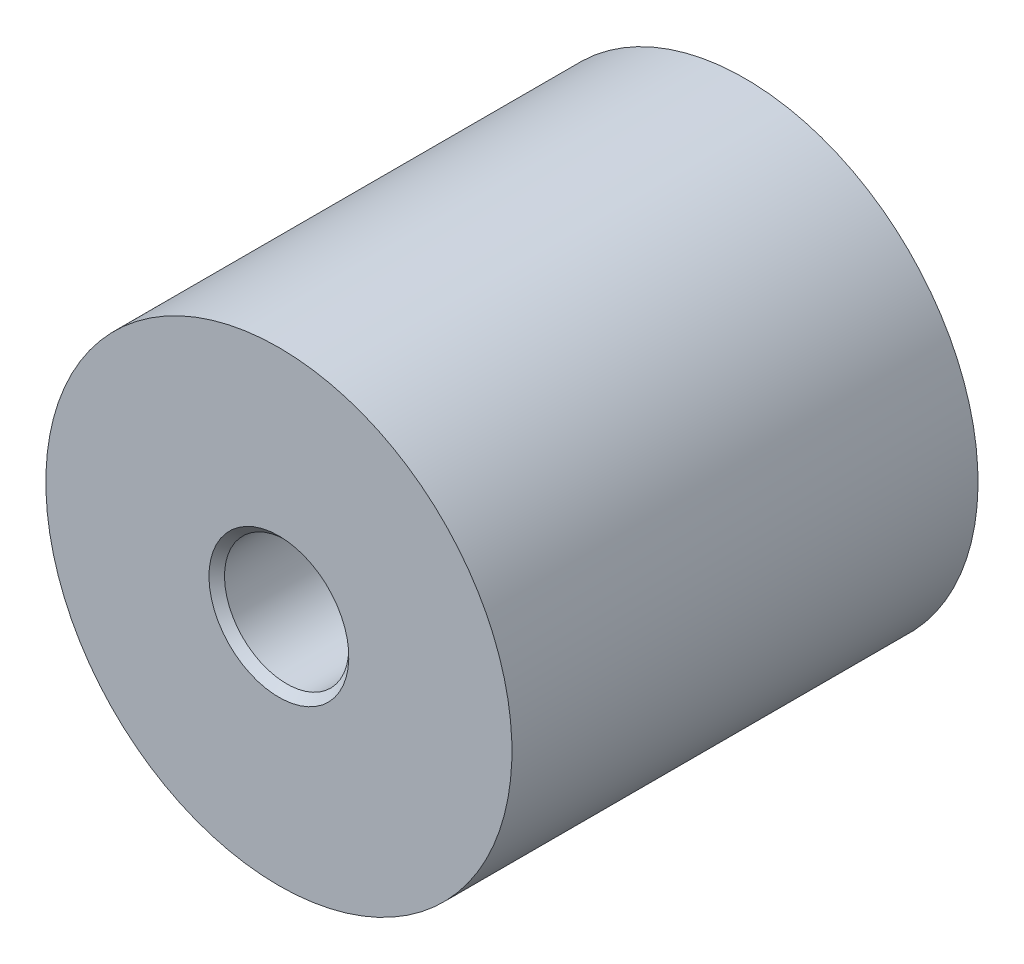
ISO-10303-21;
HEADER;
FILE_DESCRIPTION(('STEP AP214'),'2;1');
FILE_NAME('part.step','',(''),(''),'','','');
FILE_SCHEMA(('AUTOMOTIVE_DESIGN { 1 0 10303 214 1 1 1 1 }'));
ENDSEC;
DATA;
#1=APPLICATION_CONTEXT('core data for automotive mechanical design processes');
#2=APPLICATION_PROTOCOL_DEFINITION('international standard','automotive_design',2000,#1);
#3=PRODUCT_CONTEXT('',#1,'mechanical');
#4=PRODUCT('Part','Part','',(#3));
#5=PRODUCT_RELATED_PRODUCT_CATEGORY('part','',(#4));
#6=PRODUCT_DEFINITION_FORMATION('','',#4);
#7=PRODUCT_DEFINITION_CONTEXT('part definition',#1,'design');
#8=PRODUCT_DEFINITION('design','',#6,#7);
#9=PRODUCT_DEFINITION_SHAPE('','',#8);
#10=(LENGTH_UNIT() NAMED_UNIT(*) SI_UNIT(.MILLI.,.METRE.));
#11=(NAMED_UNIT(*) PLANE_ANGLE_UNIT() SI_UNIT($,.RADIAN.));
#12=(NAMED_UNIT(*) SI_UNIT($,.STERADIAN.) SOLID_ANGLE_UNIT());
#13=UNCERTAINTY_MEASURE_WITH_UNIT(LENGTH_MEASURE(1.E-05),#10,'distance_accuracy_value','');
#14=(GEOMETRIC_REPRESENTATION_CONTEXT(3) GLOBAL_UNCERTAINTY_ASSIGNED_CONTEXT((#13)) GLOBAL_UNIT_ASSIGNED_CONTEXT((#10,
#11,#12)) REPRESENTATION_CONTEXT('',''));
#15=CARTESIAN_POINT('',(0.,0.,0.));
#16=DIRECTION('',(0.,0.,1.));
#17=DIRECTION('',(1.,0.,0.));
#18=AXIS2_PLACEMENT_3D('',#15,#16,#17);
#19=CARTESIAN_POINT('',(0.,0.,0.66666666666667));
#20=DIRECTION('',(0.,0.,1.));
#21=DIRECTION('',(0.,-1.,0.));
#22=AXIS2_PLACEMENT_3D('',#19,#20,#21);
#23=CYLINDRICAL_SURFACE('',#22,15.);
#24=CARTESIAN_POINT('',(0.,0.,0.));
#25=DIRECTION('',(0.,0.,1.));
#26=DIRECTION('',(0.,-1.,0.));
#27=AXIS2_PLACEMENT_3D('',#24,#25,#26);
#28=CIRCLE('',#27,15.);
#29=CARTESIAN_POINT('',(0.,-15.,0.));
#30=VERTEX_POINT('',#29);
#31=EDGE_CURVE('E23',#30,#30,#28,.T.);
#32=ORIENTED_EDGE('',*,*,#31,.T.);
#33=EDGE_LOOP('',(#32));
#34=FACE_BOUND('',#33,.T.);
#35=CARTESIAN_POINT('',(0.,0.,30.));
#36=DIRECTION('',(0.,0.,-1.));
#37=DIRECTION('',(0.,1.,0.));
#38=AXIS2_PLACEMENT_3D('',#35,#36,#37);
#39=CIRCLE('',#38,15.);
#40=CARTESIAN_POINT('',(0.,15.,30.));
#41=VERTEX_POINT('',#40);
#42=EDGE_CURVE('E32',#41,#41,#39,.T.);
#43=ORIENTED_EDGE('',*,*,#42,.T.);
#44=EDGE_LOOP('',(#43));
#45=FACE_BOUND('',#44,.T.);
#46=ADVANCED_FACE('F12',(#34,#45),#23,.T.);
#47=CARTESIAN_POINT('',(15.,0.,0.));
#48=DIRECTION('',(0.,0.,-1.));
#49=DIRECTION('',(0.,1.,0.));
#50=AXIS2_PLACEMENT_3D('',#47,#48,#49);
#51=PLANE('',#50);
#52=CARTESIAN_POINT('',(0.,0.,0.));
#53=DIRECTION('',(0.,0.,-1.));
#54=DIRECTION('',(0.,1.,0.));
#55=AXIS2_PLACEMENT_3D('',#52,#53,#54);
#56=CIRCLE('',#55,4.5);
#57=CARTESIAN_POINT('',(0.,4.5,0.));
#58=VERTEX_POINT('',#57);
#59=EDGE_CURVE('E8',#58,#58,#56,.F.);
#60=ORIENTED_EDGE('',*,*,#59,.T.);
#61=EDGE_LOOP('',(#60));
#62=FACE_BOUND('',#61,.T.);
#63=ORIENTED_EDGE('',*,*,#31,.F.);
#64=EDGE_LOOP('',(#63));
#65=FACE_BOUND('',#64,.T.);
#66=ADVANCED_FACE('F58',(#62,#65),#51,.T.);
#67=CARTESIAN_POINT('',(0.,0.,0.));
#68=DIRECTION('',(0.,0.,1.));
#69=DIRECTION('',(0.,-1.,0.));
#70=AXIS2_PLACEMENT_3D('',#67,#68,#69);
#71=CYLINDRICAL_SURFACE('',#70,4.);
#72=CARTESIAN_POINT('',(0.,0.,0.5));
#73=DIRECTION('',(0.,0.,-1.));
#74=DIRECTION('',(0.,1.,0.));
#75=AXIS2_PLACEMENT_3D('',#72,#73,#74);
#76=CIRCLE('',#75,4.);
#77=CARTESIAN_POINT('',(0.,4.,0.5));
#78=VERTEX_POINT('',#77);
#79=EDGE_CURVE('E19',#78,#78,#76,.T.);
#80=ORIENTED_EDGE('',*,*,#79,.T.);
#81=EDGE_LOOP('',(#80));
#82=FACE_BOUND('',#81,.T.);
#83=CARTESIAN_POINT('',(0.,0.,8.));
#84=DIRECTION('',(0.,0.,-1.));
#85=DIRECTION('',(0.,1.,0.));
#86=AXIS2_PLACEMENT_3D('',#83,#84,#85);
#87=CIRCLE('',#86,4.);
#88=CARTESIAN_POINT('',(0.,4.,8.));
#89=VERTEX_POINT('',#88);
#90=EDGE_CURVE('E27',#89,#89,#87,.T.);
#91=ORIENTED_EDGE('',*,*,#90,.F.);
#92=EDGE_LOOP('',(#91));
#93=FACE_BOUND('',#92,.T.);
#94=ADVANCED_FACE('F63',(#82,#93),#71,.F.);
#95=CARTESIAN_POINT('',(0.,0.,8.));
#96=DIRECTION('',(0.,0.,-1.));
#97=DIRECTION('',(0.,1.,0.));
#98=AXIS2_PLACEMENT_3D('',#95,#96,#97);
#99=PLANE('',#98);
#100=ORIENTED_EDGE('',*,*,#90,.T.);
#101=EDGE_LOOP('',(#100));
#102=FACE_BOUND('',#101,.T.);
#103=ADVANCED_FACE('F69',(#102),#99,.T.);
#104=CARTESIAN_POINT('',(0.,0.,0.5));
#105=DIRECTION('',(0.,0.,-1.));
#106=DIRECTION('',(0.,1.,0.));
#107=AXIS2_PLACEMENT_3D('',#104,#105,#106);
#108=CONICAL_SURFACE('',#107,4.,0.785398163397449);
#109=ORIENTED_EDGE('',*,*,#59,.F.);
#110=EDGE_LOOP('',(#109));
#111=FACE_BOUND('',#110,.T.);
#112=ORIENTED_EDGE('',*,*,#79,.F.);
#113=EDGE_LOOP('',(#112));
#114=FACE_BOUND('',#113,.T.);
#115=ADVANCED_FACE('F14',(#111,#114),#108,.F.);
#116=CARTESIAN_POINT('',(15.,0.,30.));
#117=DIRECTION('',(0.,0.,1.));
#118=DIRECTION('',(0.,-1.,0.));
#119=AXIS2_PLACEMENT_3D('',#116,#117,#118);
#120=PLANE('',#119);
#121=CARTESIAN_POINT('',(0.,0.,30.));
#122=DIRECTION('',(0.,0.,-1.));
#123=DIRECTION('',(0.,1.,0.));
#124=AXIS2_PLACEMENT_3D('',#121,#122,#123);
#125=CIRCLE('',#124,4.5);
#126=CARTESIAN_POINT('',(0.,4.5,30.));
#127=VERTEX_POINT('',#126);
#128=EDGE_CURVE('E35',#127,#127,#125,.T.);
#129=ORIENTED_EDGE('',*,*,#128,.T.);
#130=EDGE_LOOP('',(#129));
#131=FACE_BOUND('',#130,.T.);
#132=ORIENTED_EDGE('',*,*,#42,.F.);
#133=EDGE_LOOP('',(#132));
#134=FACE_BOUND('',#133,.T.);
#135=ADVANCED_FACE('F73',(#131,#134),#120,.T.);
#136=CARTESIAN_POINT('',(0.,0.,30.));
#137=DIRECTION('',(0.,0.,1.));
#138=DIRECTION('',(0.,-1.,0.));
#139=AXIS2_PLACEMENT_3D('',#136,#137,#138);
#140=CONICAL_SURFACE('',#139,4.5,0.785398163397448);
#141=CARTESIAN_POINT('',(0.,0.,29.5));
#142=DIRECTION('',(0.,0.,-1.));
#143=DIRECTION('',(0.,1.,0.));
#144=AXIS2_PLACEMENT_3D('',#141,#142,#143);
#145=CIRCLE('',#144,4.);
#146=CARTESIAN_POINT('',(0.,4.,29.5));
#147=VERTEX_POINT('',#146);
#148=EDGE_CURVE('E38',#147,#147,#145,.T.);
#149=ORIENTED_EDGE('',*,*,#148,.T.);
#150=EDGE_LOOP('',(#149));
#151=FACE_BOUND('',#150,.T.);
#152=ORIENTED_EDGE('',*,*,#128,.F.);
#153=EDGE_LOOP('',(#152));
#154=FACE_BOUND('',#153,.T.);
#155=ADVANCED_FACE('F55',(#151,#154),#140,.F.);
#156=CARTESIAN_POINT('',(0.,0.,0.));
#157=DIRECTION('',(0.,0.,-1.));
#158=DIRECTION('',(0.,1.,0.));
#159=AXIS2_PLACEMENT_3D('',#156,#157,#158);
#160=CYLINDRICAL_SURFACE('',#159,4.);
#161=CARTESIAN_POINT('',(0.,0.,22.));
#162=DIRECTION('',(0.,0.,-1.));
#163=DIRECTION('',(0.,1.,0.));
#164=AXIS2_PLACEMENT_3D('',#161,#162,#163);
#165=CIRCLE('',#164,4.);
#166=CARTESIAN_POINT('',(0.,4.,22.));
#167=VERTEX_POINT('',#166);
#168=EDGE_CURVE('E41',#167,#167,#165,.T.);
#169=ORIENTED_EDGE('',*,*,#168,.T.);
#170=EDGE_LOOP('',(#169));
#171=FACE_BOUND('',#170,.T.);
#172=ORIENTED_EDGE('',*,*,#148,.F.);
#173=EDGE_LOOP('',(#172));
#174=FACE_BOUND('',#173,.T.);
#175=ADVANCED_FACE('F45',(#171,#174),#160,.F.);
#176=CARTESIAN_POINT('',(4.,0.,22.));
#177=DIRECTION('',(0.,0.,1.));
#178=DIRECTION('',(0.,-1.,0.));
#179=AXIS2_PLACEMENT_3D('',#176,#177,#178);
#180=PLANE('',#179);
#181=ORIENTED_EDGE('',*,*,#168,.F.);
#182=EDGE_LOOP('',(#181));
#183=FACE_BOUND('',#182,.T.);
#184=ADVANCED_FACE('F48',(#183),#180,.T.);
#185=CLOSED_SHELL('',(#46,#66,#94,#103,#115,#135,#155,#175,#184));
#186=MANIFOLD_SOLID_BREP('B1',#185);
#187=ADVANCED_BREP_SHAPE_REPRESENTATION('',(#18,#186),#14);
#188=SHAPE_DEFINITION_REPRESENTATION(#9,#187);
ENDSEC;
END-ISO-10303-21;
